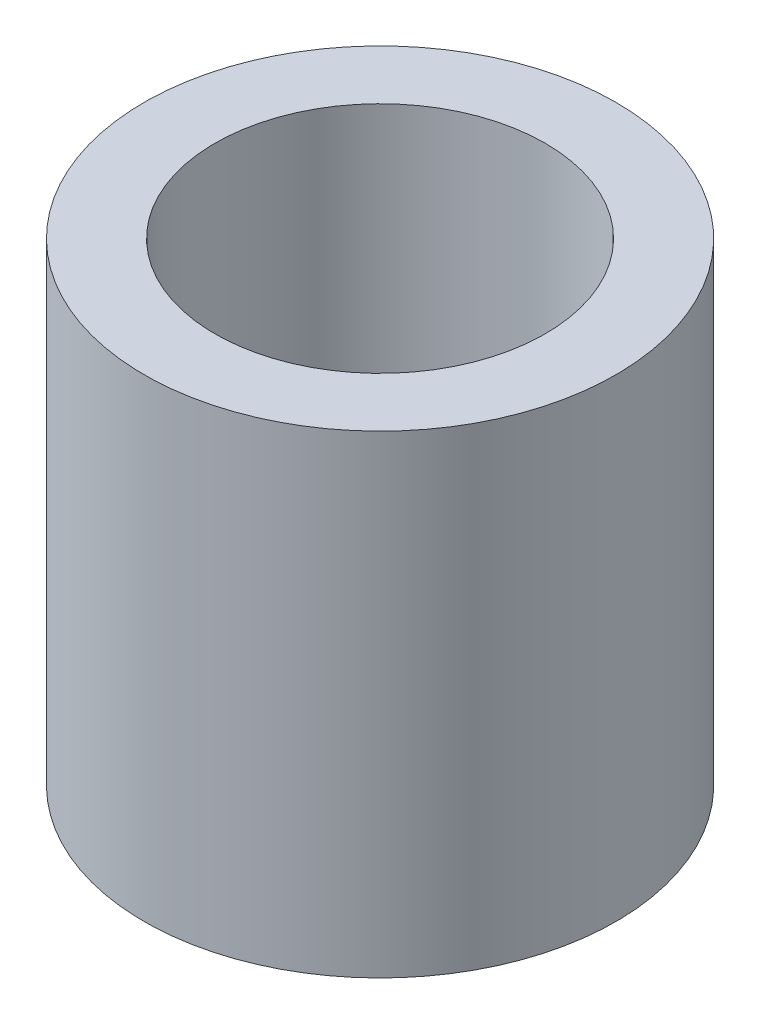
ISO-10303-21;
HEADER;
FILE_DESCRIPTION(('STEP AP214'),'2;1');
FILE_NAME('part.step','',(''),(''),'','','');
FILE_SCHEMA(('AUTOMOTIVE_DESIGN { 1 0 10303 214 1 1 1 1 }'));
ENDSEC;
DATA;
#1=APPLICATION_CONTEXT('core data for automotive mechanical design processes');
#2=APPLICATION_PROTOCOL_DEFINITION('international standard','automotive_design',2000,#1);
#3=PRODUCT_CONTEXT('',#1,'mechanical');
#4=PRODUCT('Part','Part','',(#3));
#5=PRODUCT_RELATED_PRODUCT_CATEGORY('part','',(#4));
#6=PRODUCT_DEFINITION_FORMATION('','',#4);
#7=PRODUCT_DEFINITION_CONTEXT('part definition',#1,'design');
#8=PRODUCT_DEFINITION('design','',#6,#7);
#9=PRODUCT_DEFINITION_SHAPE('','',#8);
#10=(LENGTH_UNIT() NAMED_UNIT(*) SI_UNIT(.MILLI.,.METRE.));
#11=(NAMED_UNIT(*) PLANE_ANGLE_UNIT() SI_UNIT($,.RADIAN.));
#12=(NAMED_UNIT(*) SI_UNIT($,.STERADIAN.) SOLID_ANGLE_UNIT());
#13=UNCERTAINTY_MEASURE_WITH_UNIT(LENGTH_MEASURE(1.E-05),#10,'distance_accuracy_value','');
#14=(GEOMETRIC_REPRESENTATION_CONTEXT(3) GLOBAL_UNCERTAINTY_ASSIGNED_CONTEXT((#13)) GLOBAL_UNIT_ASSIGNED_CONTEXT((#10,
#11,#12)) REPRESENTATION_CONTEXT('',''));
#15=CARTESIAN_POINT('',(0.,0.,0.));
#16=DIRECTION('',(0.,0.,1.));
#17=DIRECTION('',(1.,0.,0.));
#18=AXIS2_PLACEMENT_3D('',#15,#16,#17);
#19=CARTESIAN_POINT('',(0.,0.,0.));
#20=DIRECTION('',(0.,-1.,0.));
#21=DIRECTION('',(0.,0.,-1.));
#22=AXIS2_PLACEMENT_3D('',#19,#20,#21);
#23=CYLINDRICAL_SURFACE('',#22,14.);
#24=CARTESIAN_POINT('',(0.,0.,0.));
#25=DIRECTION('',(0.,-1.,0.));
#26=DIRECTION('',(0.,0.,-1.));
#27=AXIS2_PLACEMENT_3D('',#24,#25,#26);
#28=CIRCLE('',#27,14.);
#29=CARTESIAN_POINT('',(0.,0.,-14.));
#30=VERTEX_POINT('',#29);
#31=EDGE_CURVE('E43',#30,#30,#28,.T.);
#32=ORIENTED_EDGE('',*,*,#31,.T.);
#33=EDGE_LOOP('',(#32));
#34=FACE_BOUND('',#33,.T.);
#35=CARTESIAN_POINT('',(0.,40.15,0.));
#36=DIRECTION('',(0.,-1.,0.));
#37=DIRECTION('',(0.,0.,-1.));
#38=AXIS2_PLACEMENT_3D('',#35,#36,#37);
#39=CIRCLE('',#38,14.);
#40=CARTESIAN_POINT('',(0.,40.15,-14.));
#41=VERTEX_POINT('',#40);
#42=EDGE_CURVE('E10',#41,#41,#39,.T.);
#43=ORIENTED_EDGE('',*,*,#42,.F.);
#44=EDGE_LOOP('',(#43));
#45=FACE_BOUND('',#44,.T.);
#46=ADVANCED_FACE('F29',(#34,#45),#23,.F.);
#47=CARTESIAN_POINT('',(14.,40.15,0.));
#48=DIRECTION('',(0.,1.,0.));
#49=DIRECTION('',(0.,0.,1.));
#50=AXIS2_PLACEMENT_3D('',#47,#48,#49);
#51=PLANE('',#50);
#52=ORIENTED_EDGE('',*,*,#42,.T.);
#53=EDGE_LOOP('',(#52));
#54=FACE_BOUND('',#53,.T.);
#55=CARTESIAN_POINT('',(0.,40.15,0.));
#56=DIRECTION('',(0.,-1.,0.));
#57=DIRECTION('',(0.,0.,-1.));
#58=AXIS2_PLACEMENT_3D('',#55,#56,#57);
#59=CIRCLE('',#58,20.);
#60=CARTESIAN_POINT('',(0.,40.15,-20.));
#61=VERTEX_POINT('',#60);
#62=EDGE_CURVE('E35',#61,#61,#59,.T.);
#63=ORIENTED_EDGE('',*,*,#62,.F.);
#64=EDGE_LOOP('',(#63));
#65=FACE_BOUND('',#64,.T.);
#66=ADVANCED_FACE('F59',(#54,#65),#51,.T.);
#67=CARTESIAN_POINT('',(0.,0.,0.));
#68=DIRECTION('',(0.,-1.,0.));
#69=DIRECTION('',(0.,0.,-1.));
#70=AXIS2_PLACEMENT_3D('',#67,#68,#69);
#71=CYLINDRICAL_SURFACE('',#70,20.);
#72=ORIENTED_EDGE('',*,*,#62,.T.);
#73=EDGE_LOOP('',(#72));
#74=FACE_BOUND('',#73,.T.);
#75=CARTESIAN_POINT('',(0.,0.,0.));
#76=DIRECTION('',(0.,-1.,0.));
#77=DIRECTION('',(0.,0.,-1.));
#78=AXIS2_PLACEMENT_3D('',#75,#76,#77);
#79=CIRCLE('',#78,20.);
#80=CARTESIAN_POINT('',(0.,0.,-20.));
#81=VERTEX_POINT('',#80);
#82=EDGE_CURVE('E39',#81,#81,#79,.T.);
#83=ORIENTED_EDGE('',*,*,#82,.F.);
#84=EDGE_LOOP('',(#83));
#85=FACE_BOUND('',#84,.T.);
#86=ADVANCED_FACE('F53',(#74,#85),#71,.T.);
#87=CARTESIAN_POINT('',(14.,0.,0.));
#88=DIRECTION('',(0.,-1.,0.));
#89=DIRECTION('',(0.,0.,-1.));
#90=AXIS2_PLACEMENT_3D('',#87,#88,#89);
#91=PLANE('',#90);
#92=ORIENTED_EDGE('',*,*,#82,.T.);
#93=EDGE_LOOP('',(#92));
#94=FACE_BOUND('',#93,.T.);
#95=ORIENTED_EDGE('',*,*,#31,.F.);
#96=EDGE_LOOP('',(#95));
#97=FACE_BOUND('',#96,.T.);
#98=ADVANCED_FACE('F51',(#94,#97),#91,.T.);
#99=CLOSED_SHELL('',(#46,#66,#86,#98));
#100=MANIFOLD_SOLID_BREP('B2',#99);
#101=ADVANCED_BREP_SHAPE_REPRESENTATION('',(#18,#100),#14);
#102=SHAPE_DEFINITION_REPRESENTATION(#9,#101);
ENDSEC;
END-ISO-10303-21;
